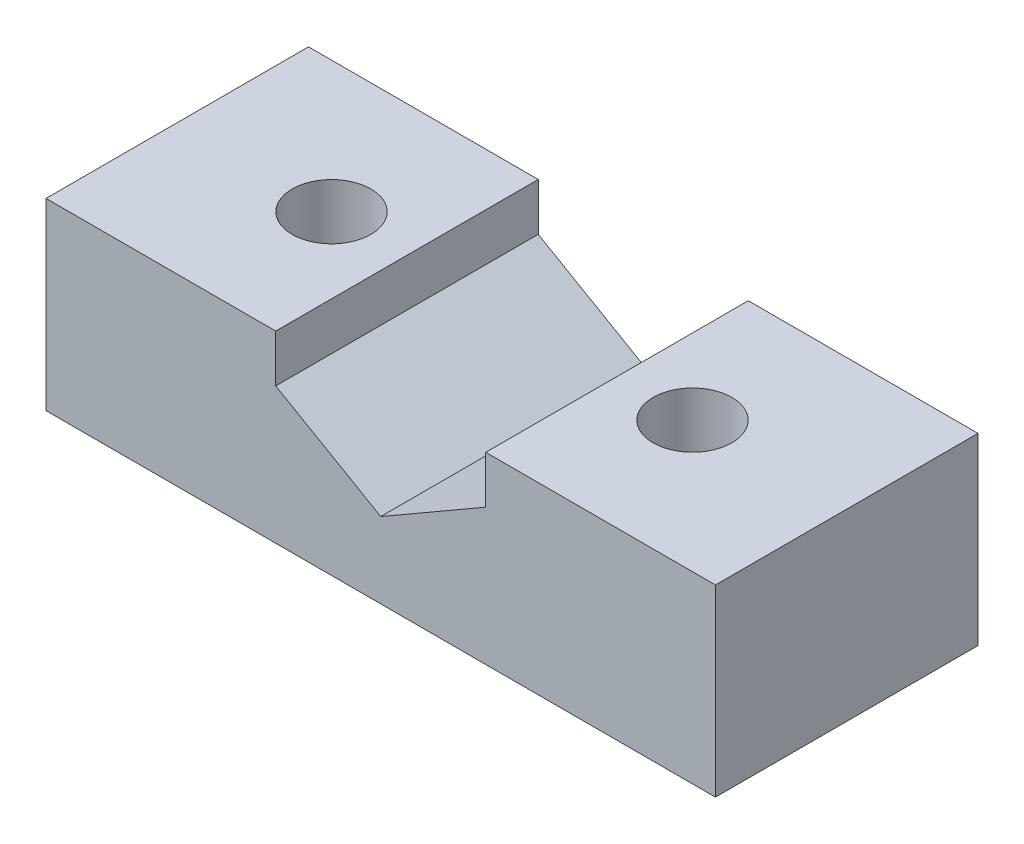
ISO-10303-21;
HEADER;
FILE_DESCRIPTION(('STEP AP214'),'2;1');
FILE_NAME('part.step','',(''),(''),'','','');
FILE_SCHEMA(('AUTOMOTIVE_DESIGN { 1 0 10303 214 1 1 1 1 }'));
ENDSEC;
DATA;
#1=APPLICATION_CONTEXT('core data for automotive mechanical design processes');
#2=APPLICATION_PROTOCOL_DEFINITION('international standard','automotive_design',2000,#1);
#3=PRODUCT_CONTEXT('',#1,'mechanical');
#4=PRODUCT('Part','Part','',(#3));
#5=PRODUCT_RELATED_PRODUCT_CATEGORY('part','',(#4));
#6=PRODUCT_DEFINITION_FORMATION('','',#4);
#7=PRODUCT_DEFINITION_CONTEXT('part definition',#1,'design');
#8=PRODUCT_DEFINITION('design','',#6,#7);
#9=PRODUCT_DEFINITION_SHAPE('','',#8);
#10=(LENGTH_UNIT() NAMED_UNIT(*) SI_UNIT(.MILLI.,.METRE.));
#11=(NAMED_UNIT(*) PLANE_ANGLE_UNIT() SI_UNIT($,.RADIAN.));
#12=(NAMED_UNIT(*) SI_UNIT($,.STERADIAN.) SOLID_ANGLE_UNIT());
#13=UNCERTAINTY_MEASURE_WITH_UNIT(LENGTH_MEASURE(1.E-05),#10,'distance_accuracy_value','');
#14=(GEOMETRIC_REPRESENTATION_CONTEXT(3) GLOBAL_UNCERTAINTY_ASSIGNED_CONTEXT((#13)) GLOBAL_UNIT_ASSIGNED_CONTEXT((#10,
#11,#12)) REPRESENTATION_CONTEXT('',''));
#15=CARTESIAN_POINT('',(0.,0.,0.));
#16=DIRECTION('',(0.,0.,1.));
#17=DIRECTION('',(1.,0.,0.));
#18=AXIS2_PLACEMENT_3D('',#15,#16,#17);
#19=CARTESIAN_POINT('',(0.,7.,0.));
#20=DIRECTION('',(0.,-1.,0.));
#21=DIRECTION('',(0.,0.,-1.));
#22=AXIS2_PLACEMENT_3D('',#19,#20,#21);
#23=PLANE('',#22);
#24=CARTESIAN_POINT('',(-6.875,7.,0.));
#25=DIRECTION('',(0.,1.,0.));
#26=DIRECTION('',(0.,0.,1.));
#27=AXIS2_PLACEMENT_3D('',#24,#25,#26);
#28=CIRCLE('',#27,1.5);
#29=CARTESIAN_POINT('',(-6.875,7.,1.5));
#30=VERTEX_POINT('',#29);
#31=EDGE_CURVE('E158',#30,#30,#28,.T.);
#32=ORIENTED_EDGE('',*,*,#31,.F.);
#33=EDGE_LOOP('',(#32));
#34=FACE_BOUND('',#33,.T.);
#35=DIRECTION('',(1.,0.,0.));
#36=VECTOR('',#35,1.);
#37=CARTESIAN_POINT('',(-12.75,7.,5.));
#38=LINE('',#37,#36);
#39=CARTESIAN_POINT('',(-12.75,7.,5.));
#40=VERTEX_POINT('',#39);
#41=CARTESIAN_POINT('',(-4.,7.,5.));
#42=VERTEX_POINT('',#41);
#43=EDGE_CURVE('E178',#40,#42,#38,.T.);
#44=ORIENTED_EDGE('',*,*,#43,.T.);
#45=DIRECTION('',(0.,0.,-1.));
#46=VECTOR('',#45,1.);
#47=CARTESIAN_POINT('',(-4.,7.,0.));
#48=LINE('',#47,#46);
#49=CARTESIAN_POINT('',(-4.,7.,-5.));
#50=VERTEX_POINT('',#49);
#51=EDGE_CURVE('E13',#42,#50,#48,.T.);
#52=ORIENTED_EDGE('',*,*,#51,.T.);
#53=DIRECTION('',(-1.,0.,0.));
#54=VECTOR('',#53,1.);
#55=CARTESIAN_POINT('',(-12.75,7.,-5.));
#56=LINE('',#55,#54);
#57=CARTESIAN_POINT('',(-12.75,7.,-5.));
#58=VERTEX_POINT('',#57);
#59=EDGE_CURVE('E174',#50,#58,#56,.T.);
#60=ORIENTED_EDGE('',*,*,#59,.T.);
#61=DIRECTION('',(0.,0.,1.));
#62=VECTOR('',#61,1.);
#63=CARTESIAN_POINT('',(-12.75,7.,5.));
#64=LINE('',#63,#62);
#65=EDGE_CURVE('E176',#58,#40,#64,.T.);
#66=ORIENTED_EDGE('',*,*,#65,.T.);
#67=EDGE_LOOP('',(#44,#52,#60,#66));
#68=FACE_BOUND('',#67,.T.);
#69=ADVANCED_FACE('F51',(#34,#68),#23,.F.);
#70=CARTESIAN_POINT('',(12.75,7.,5.));
#71=DIRECTION('',(-1.,0.,0.));
#72=DIRECTION('',(0.,0.,1.));
#73=AXIS2_PLACEMENT_3D('',#70,#71,#72);
#74=PLANE('',#73);
#75=DIRECTION('',(0.,0.,-1.));
#76=VECTOR('',#75,1.);
#77=CARTESIAN_POINT('',(12.75,0.,5.));
#78=LINE('',#77,#76);
#79=CARTESIAN_POINT('',(12.75,0.,5.));
#80=VERTEX_POINT('',#79);
#81=CARTESIAN_POINT('',(12.75,0.,-5.));
#82=VERTEX_POINT('',#81);
#83=EDGE_CURVE('E169',#80,#82,#78,.T.);
#84=ORIENTED_EDGE('',*,*,#83,.T.);
#85=DIRECTION('',(0.,-1.,0.));
#86=VECTOR('',#85,1.);
#87=CARTESIAN_POINT('',(12.75,7.,-5.));
#88=LINE('',#87,#86);
#89=CARTESIAN_POINT('',(12.75,7.,-5.));
#90=VERTEX_POINT('',#89);
#91=EDGE_CURVE('E195',#90,#82,#88,.T.);
#92=ORIENTED_EDGE('',*,*,#91,.F.);
#93=DIRECTION('',(0.,0.,-1.));
#94=VECTOR('',#93,1.);
#95=CARTESIAN_POINT('',(12.75,7.,5.));
#96=LINE('',#95,#94);
#97=CARTESIAN_POINT('',(12.75,7.,5.));
#98=VERTEX_POINT('',#97);
#99=EDGE_CURVE('E172',#98,#90,#96,.T.);
#100=ORIENTED_EDGE('',*,*,#99,.F.);
#101=DIRECTION('',(0.,-1.,0.));
#102=VECTOR('',#101,1.);
#103=CARTESIAN_POINT('',(12.75,7.,5.));
#104=LINE('',#103,#102);
#105=EDGE_CURVE('E181',#98,#80,#104,.T.);
#106=ORIENTED_EDGE('',*,*,#105,.T.);
#107=EDGE_LOOP('',(#84,#92,#100,#106));
#108=FACE_BOUND('',#107,.T.);
#109=ADVANCED_FACE('F53',(#108),#74,.F.);
#110=CARTESIAN_POINT('',(-12.75,7.,-5.));
#111=DIRECTION('',(0.,0.,1.));
#112=DIRECTION('',(1.,0.,0.));
#113=AXIS2_PLACEMENT_3D('',#110,#111,#112);
#114=PLANE('',#113);
#115=ORIENTED_EDGE('',*,*,#59,.F.);
#116=DIRECTION('',(0.,-1.,0.));
#117=VECTOR('',#116,1.);
#118=CARTESIAN_POINT('',(-4.,9.8094010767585,-5.));
#119=LINE('',#118,#117);
#120=CARTESIAN_POINT('',(-4.,5.1905989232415,-5.));
#121=VERTEX_POINT('',#120);
#122=EDGE_CURVE('E146',#50,#121,#119,.T.);
#123=ORIENTED_EDGE('',*,*,#122,.T.);
#124=DIRECTION('',(0.866025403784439,-0.5,0.));
#125=VECTOR('',#124,1.);
#126=CARTESIAN_POINT('',(-4.,5.1905989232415,-5.));
#127=LINE('',#126,#125);
#128=CARTESIAN_POINT('',(0.,2.88119784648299,-5.));
#129=VERTEX_POINT('',#128);
#130=EDGE_CURVE('E142',#121,#129,#127,.T.);
#131=ORIENTED_EDGE('',*,*,#130,.T.);
#132=DIRECTION('',(0.866025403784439,0.5,0.));
#133=VECTOR('',#132,1.);
#134=CARTESIAN_POINT('',(0.,2.88119784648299,-5.));
#135=LINE('',#134,#133);
#136=CARTESIAN_POINT('',(4.,5.1905989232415,-5.));
#137=VERTEX_POINT('',#136);
#138=EDGE_CURVE('E137',#129,#137,#135,.T.);
#139=ORIENTED_EDGE('',*,*,#138,.T.);
#140=DIRECTION('',(0.,1.,0.));
#141=VECTOR('',#140,1.);
#142=CARTESIAN_POINT('',(4.,5.1905989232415,-5.));
#143=LINE('',#142,#141);
#144=CARTESIAN_POINT('',(4.,7.,-5.));
#145=VERTEX_POINT('',#144);
#146=EDGE_CURVE('E144',#137,#145,#143,.T.);
#147=ORIENTED_EDGE('',*,*,#146,.T.);
#148=EDGE_CURVE('E104',#90,#145,#56,.T.);
#149=ORIENTED_EDGE('',*,*,#148,.F.);
#150=ORIENTED_EDGE('',*,*,#91,.T.);
#151=DIRECTION('',(-1.,0.,0.));
#152=VECTOR('',#151,1.);
#153=CARTESIAN_POINT('',(-12.75,0.,-5.));
#154=LINE('',#153,#152);
#155=CARTESIAN_POINT('',(-12.75,0.,-5.));
#156=VERTEX_POINT('',#155);
#157=EDGE_CURVE('E184',#82,#156,#154,.T.);
#158=ORIENTED_EDGE('',*,*,#157,.T.);
#159=DIRECTION('',(0.,-1.,0.));
#160=VECTOR('',#159,1.);
#161=CARTESIAN_POINT('',(-12.75,7.,-5.));
#162=LINE('',#161,#160);
#163=EDGE_CURVE('E192',#58,#156,#162,.T.);
#164=ORIENTED_EDGE('',*,*,#163,.F.);
#165=EDGE_LOOP('',(#115,#123,#131,#139,#147,#149,#150,#158,#164));
#166=FACE_BOUND('',#165,.T.);
#167=ADVANCED_FACE('F149',(#166),#114,.F.);
#168=CARTESIAN_POINT('',(-12.75,7.,5.));
#169=DIRECTION('',(1.,0.,0.));
#170=DIRECTION('',(0.,0.,-1.));
#171=AXIS2_PLACEMENT_3D('',#168,#169,#170);
#172=PLANE('',#171);
#173=DIRECTION('',(0.,0.,1.));
#174=VECTOR('',#173,1.);
#175=CARTESIAN_POINT('',(-12.75,0.,5.));
#176=LINE('',#175,#174);
#177=CARTESIAN_POINT('',(-12.75,0.,5.));
#178=VERTEX_POINT('',#177);
#179=EDGE_CURVE('E186',#156,#178,#176,.T.);
#180=ORIENTED_EDGE('',*,*,#179,.T.);
#181=DIRECTION('',(0.,-1.,0.));
#182=VECTOR('',#181,1.);
#183=CARTESIAN_POINT('',(-12.75,7.,5.));
#184=LINE('',#183,#182);
#185=EDGE_CURVE('E190',#40,#178,#184,.T.);
#186=ORIENTED_EDGE('',*,*,#185,.F.);
#187=ORIENTED_EDGE('',*,*,#65,.F.);
#188=ORIENTED_EDGE('',*,*,#163,.T.);
#189=EDGE_LOOP('',(#180,#186,#187,#188));
#190=FACE_BOUND('',#189,.T.);
#191=ADVANCED_FACE('F208',(#190),#172,.F.);
#192=CARTESIAN_POINT('',(-12.75,7.,5.));
#193=DIRECTION('',(0.,0.,-1.));
#194=DIRECTION('',(-1.,0.,0.));
#195=AXIS2_PLACEMENT_3D('',#192,#193,#194);
#196=PLANE('',#195);
#197=DIRECTION('',(0.866025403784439,-0.5,0.));
#198=VECTOR('',#197,1.);
#199=CARTESIAN_POINT('',(-4.,5.1905989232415,5.));
#200=LINE('',#199,#198);
#201=CARTESIAN_POINT('',(-4.,5.1905989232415,5.));
#202=VERTEX_POINT('',#201);
#203=CARTESIAN_POINT('',(0.,2.88119784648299,5.));
#204=VERTEX_POINT('',#203);
#205=EDGE_CURVE('E152',#202,#204,#200,.T.);
#206=ORIENTED_EDGE('',*,*,#205,.F.);
#207=DIRECTION('',(0.,-1.,0.));
#208=VECTOR('',#207,1.);
#209=CARTESIAN_POINT('',(-4.,9.8094010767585,5.));
#210=LINE('',#209,#208);
#211=EDGE_CURVE('E155',#42,#202,#210,.T.);
#212=ORIENTED_EDGE('',*,*,#211,.F.);
#213=ORIENTED_EDGE('',*,*,#43,.F.);
#214=ORIENTED_EDGE('',*,*,#185,.T.);
#215=DIRECTION('',(1.,0.,0.));
#216=VECTOR('',#215,1.);
#217=CARTESIAN_POINT('',(-12.75,0.,5.));
#218=LINE('',#217,#216);
#219=EDGE_CURVE('E96',#178,#80,#218,.T.);
#220=ORIENTED_EDGE('',*,*,#219,.T.);
#221=ORIENTED_EDGE('',*,*,#105,.F.);
#222=CARTESIAN_POINT('',(4.,7.,5.));
#223=VERTEX_POINT('',#222);
#224=EDGE_CURVE('E74',#223,#98,#38,.T.);
#225=ORIENTED_EDGE('',*,*,#224,.F.);
#226=DIRECTION('',(0.,1.,0.));
#227=VECTOR('',#226,1.);
#228=CARTESIAN_POINT('',(4.,5.1905989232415,5.));
#229=LINE('',#228,#227);
#230=CARTESIAN_POINT('',(4.,5.1905989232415,5.));
#231=VERTEX_POINT('',#230);
#232=EDGE_CURVE('E66',#231,#223,#229,.T.);
#233=ORIENTED_EDGE('',*,*,#232,.F.);
#234=DIRECTION('',(0.866025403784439,0.5,0.));
#235=VECTOR('',#234,1.);
#236=CARTESIAN_POINT('',(0.,2.88119784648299,5.));
#237=LINE('',#236,#235);
#238=EDGE_CURVE('E140',#204,#231,#237,.T.);
#239=ORIENTED_EDGE('',*,*,#238,.F.);
#240=EDGE_LOOP('',(#206,#212,#213,#214,#220,#221,#225,#233,#239));
#241=FACE_BOUND('',#240,.T.);
#242=ADVANCED_FACE('F198',(#241),#196,.F.);
#243=CARTESIAN_POINT('',(6.875,7.,0.));
#244=DIRECTION('',(0.,-1.,0.));
#245=DIRECTION('',(0.,0.,1.));
#246=AXIS2_PLACEMENT_3D('',#243,#244,#245);
#247=CIRCLE('',#246,1.5);
#248=CARTESIAN_POINT('',(6.875,7.,1.5));
#249=VERTEX_POINT('',#248);
#250=EDGE_CURVE('E256',#249,#249,#247,.T.);
#251=ORIENTED_EDGE('',*,*,#250,.T.);
#252=EDGE_LOOP('',(#251));
#253=FACE_BOUND('',#252,.T.);
#254=ORIENTED_EDGE('',*,*,#148,.T.);
#255=DIRECTION('',(0.,0.,1.));
#256=VECTOR('',#255,1.);
#257=CARTESIAN_POINT('',(4.,7.,0.));
#258=LINE('',#257,#256);
#259=EDGE_CURVE('E59',#145,#223,#258,.T.);
#260=ORIENTED_EDGE('',*,*,#259,.T.);
#261=ORIENTED_EDGE('',*,*,#224,.T.);
#262=ORIENTED_EDGE('',*,*,#99,.T.);
#263=EDGE_LOOP('',(#254,#260,#261,#262));
#264=FACE_BOUND('',#263,.T.);
#265=ADVANCED_FACE('F196',(#253,#264),#23,.F.);
#266=CARTESIAN_POINT('',(0.,0.,0.));
#267=DIRECTION('',(0.,-1.,0.));
#268=DIRECTION('',(0.,0.,-1.));
#269=AXIS2_PLACEMENT_3D('',#266,#267,#268);
#270=PLANE('',#269);
#271=CARTESIAN_POINT('',(6.875,0.,0.));
#272=DIRECTION('',(0.,-1.,0.));
#273=DIRECTION('',(0.,0.,1.));
#274=AXIS2_PLACEMENT_3D('',#271,#272,#273);
#275=CIRCLE('',#274,1.5);
#276=CARTESIAN_POINT('',(6.875,0.,1.5));
#277=VERTEX_POINT('',#276);
#278=EDGE_CURVE('E253',#277,#277,#275,.T.);
#279=ORIENTED_EDGE('',*,*,#278,.F.);
#280=EDGE_LOOP('',(#279));
#281=FACE_BOUND('',#280,.T.);
#282=CARTESIAN_POINT('',(-6.875,0.,0.));
#283=DIRECTION('',(0.,1.,0.));
#284=DIRECTION('',(0.,0.,1.));
#285=AXIS2_PLACEMENT_3D('',#282,#283,#284);
#286=CIRCLE('',#285,1.5);
#287=CARTESIAN_POINT('',(-6.875,0.,1.5));
#288=VERTEX_POINT('',#287);
#289=EDGE_CURVE('E164',#288,#288,#286,.T.);
#290=ORIENTED_EDGE('',*,*,#289,.T.);
#291=EDGE_LOOP('',(#290));
#292=FACE_BOUND('',#291,.T.);
#293=ORIENTED_EDGE('',*,*,#83,.F.);
#294=ORIENTED_EDGE('',*,*,#219,.F.);
#295=ORIENTED_EDGE('',*,*,#179,.F.);
#296=ORIENTED_EDGE('',*,*,#157,.F.);
#297=EDGE_LOOP('',(#293,#294,#295,#296));
#298=FACE_BOUND('',#297,.T.);
#299=ADVANCED_FACE('F210',(#281,#292,#298),#270,.T.);
#300=CARTESIAN_POINT('',(-4.,9.8094010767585,-5.));
#301=DIRECTION('',(-1.,0.,0.));
#302=DIRECTION('',(0.,-1.,0.));
#303=AXIS2_PLACEMENT_3D('',#300,#301,#302);
#304=PLANE('',#303);
#305=ORIENTED_EDGE('',*,*,#211,.T.);
#306=DIRECTION('',(0.,0.,1.));
#307=VECTOR('',#306,1.);
#308=CARTESIAN_POINT('',(-4.,5.1905989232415,-5.));
#309=LINE('',#308,#307);
#310=EDGE_CURVE('E141',#121,#202,#309,.T.);
#311=ORIENTED_EDGE('',*,*,#310,.F.);
#312=ORIENTED_EDGE('',*,*,#122,.F.);
#313=ORIENTED_EDGE('',*,*,#51,.F.);
#314=EDGE_LOOP('',(#305,#311,#312,#313));
#315=FACE_BOUND('',#314,.T.);
#316=ADVANCED_FACE('F212',(#315),#304,.F.);
#317=CARTESIAN_POINT('',(4.,5.1905989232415,-5.));
#318=DIRECTION('',(1.,0.,0.));
#319=DIRECTION('',(0.,1.,0.));
#320=AXIS2_PLACEMENT_3D('',#317,#318,#319);
#321=PLANE('',#320);
#322=ORIENTED_EDGE('',*,*,#146,.F.);
#323=DIRECTION('',(0.,0.,1.));
#324=VECTOR('',#323,1.);
#325=CARTESIAN_POINT('',(4.,5.1905989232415,-5.));
#326=LINE('',#325,#324);
#327=EDGE_CURVE('E133',#137,#231,#326,.T.);
#328=ORIENTED_EDGE('',*,*,#327,.T.);
#329=ORIENTED_EDGE('',*,*,#232,.T.);
#330=ORIENTED_EDGE('',*,*,#259,.F.);
#331=EDGE_LOOP('',(#322,#328,#329,#330));
#332=FACE_BOUND('',#331,.T.);
#333=ADVANCED_FACE('F145',(#332),#321,.F.);
#334=CARTESIAN_POINT('',(0.,2.88119784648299,-5.));
#335=DIRECTION('',(0.5,-0.866025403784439,0.));
#336=DIRECTION('',(0.866025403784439,0.5,0.));
#337=AXIS2_PLACEMENT_3D('',#334,#335,#336);
#338=PLANE('',#337);
#339=ORIENTED_EDGE('',*,*,#238,.T.);
#340=ORIENTED_EDGE('',*,*,#327,.F.);
#341=ORIENTED_EDGE('',*,*,#138,.F.);
#342=DIRECTION('',(0.,0.,1.));
#343=VECTOR('',#342,1.);
#344=CARTESIAN_POINT('',(0.,2.88119784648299,-5.));
#345=LINE('',#344,#343);
#346=EDGE_CURVE('E167',#129,#204,#345,.T.);
#347=ORIENTED_EDGE('',*,*,#346,.T.);
#348=EDGE_LOOP('',(#339,#340,#341,#347));
#349=FACE_BOUND('',#348,.T.);
#350=ADVANCED_FACE('F135',(#349),#338,.F.);
#351=CARTESIAN_POINT('',(-4.,5.1905989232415,-5.));
#352=DIRECTION('',(-0.5,-0.866025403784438,0.));
#353=DIRECTION('',(0.866025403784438,-0.5,0.));
#354=AXIS2_PLACEMENT_3D('',#351,#352,#353);
#355=PLANE('',#354);
#356=ORIENTED_EDGE('',*,*,#205,.T.);
#357=ORIENTED_EDGE('',*,*,#346,.F.);
#358=ORIENTED_EDGE('',*,*,#130,.F.);
#359=ORIENTED_EDGE('',*,*,#310,.T.);
#360=EDGE_LOOP('',(#356,#357,#358,#359));
#361=FACE_BOUND('',#360,.T.);
#362=ADVANCED_FACE('F236',(#361),#355,.F.);
#363=CARTESIAN_POINT('',(-6.875,0.,0.));
#364=DIRECTION('',(0.,1.,0.));
#365=DIRECTION('',(0.,0.,1.));
#366=AXIS2_PLACEMENT_3D('',#363,#364,#365);
#367=CYLINDRICAL_SURFACE('',#366,1.5);
#368=ORIENTED_EDGE('',*,*,#289,.F.);
#369=EDGE_LOOP('',(#368));
#370=FACE_BOUND('',#369,.T.);
#371=ORIENTED_EDGE('',*,*,#31,.T.);
#372=EDGE_LOOP('',(#371));
#373=FACE_BOUND('',#372,.T.);
#374=ADVANCED_FACE('F241',(#370,#373),#367,.F.);
#375=CARTESIAN_POINT('',(6.875,0.,0.));
#376=DIRECTION('',(0.,1.,0.));
#377=DIRECTION('',(0.,0.,1.));
#378=AXIS2_PLACEMENT_3D('',#375,#376,#377);
#379=CYLINDRICAL_SURFACE('',#378,1.5);
#380=ORIENTED_EDGE('',*,*,#278,.T.);
#381=EDGE_LOOP('',(#380));
#382=FACE_BOUND('',#381,.T.);
#383=ORIENTED_EDGE('',*,*,#250,.F.);
#384=EDGE_LOOP('',(#383));
#385=FACE_BOUND('',#384,.T.);
#386=ADVANCED_FACE('F245',(#382,#385),#379,.F.);
#387=CLOSED_SHELL('',(#69,#109,#167,#191,#242,#265,#299,#316,#333,#350,#362,#374,#386));
#388=MANIFOLD_SOLID_BREP('B2',#387);
#389=ADVANCED_BREP_SHAPE_REPRESENTATION('',(#18,#388),#14);
#390=SHAPE_DEFINITION_REPRESENTATION(#9,#389);
ENDSEC;
END-ISO-10303-21;
